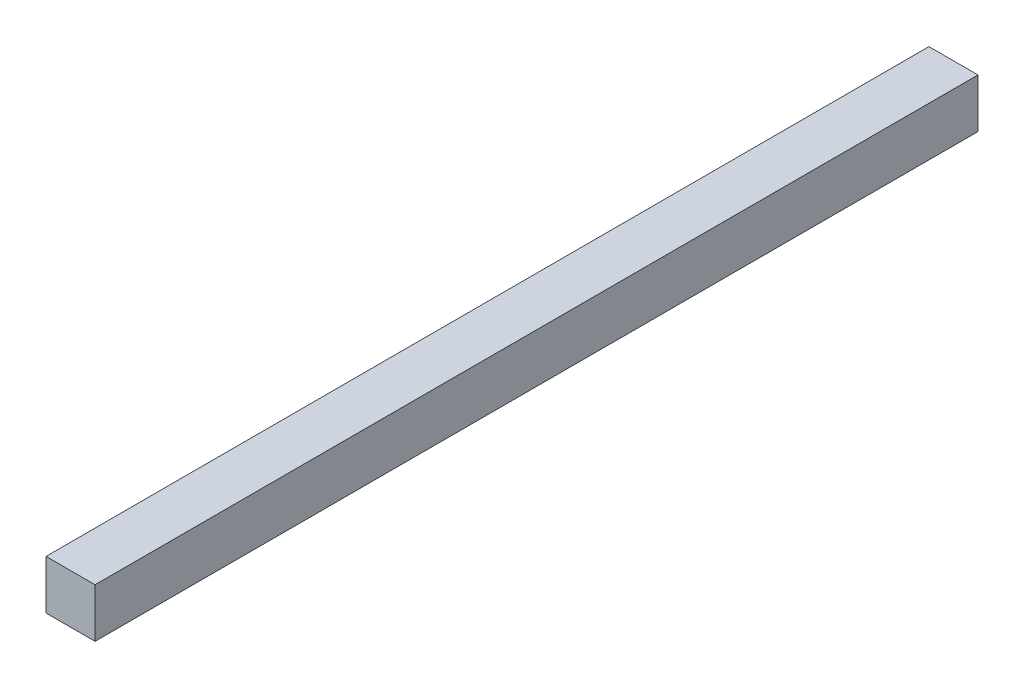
ISO-10303-21;
HEADER;
FILE_DESCRIPTION(('STEP AP214'),'2;1');
FILE_NAME('part.step','',(''),(''),'','','');
FILE_SCHEMA(('AUTOMOTIVE_DESIGN { 1 0 10303 214 1 1 1 1 }'));
ENDSEC;
DATA;
#1=APPLICATION_CONTEXT('core data for automotive mechanical design processes');
#2=APPLICATION_PROTOCOL_DEFINITION('international standard','automotive_design',2000,#1);
#3=PRODUCT_CONTEXT('',#1,'mechanical');
#4=PRODUCT('Part','Part','',(#3));
#5=PRODUCT_RELATED_PRODUCT_CATEGORY('part','',(#4));
#6=PRODUCT_DEFINITION_FORMATION('','',#4);
#7=PRODUCT_DEFINITION_CONTEXT('part definition',#1,'design');
#8=PRODUCT_DEFINITION('design','',#6,#7);
#9=PRODUCT_DEFINITION_SHAPE('','',#8);
#10=(LENGTH_UNIT() NAMED_UNIT(*) SI_UNIT(.MILLI.,.METRE.));
#11=(NAMED_UNIT(*) PLANE_ANGLE_UNIT() SI_UNIT($,.RADIAN.));
#12=(NAMED_UNIT(*) SI_UNIT($,.STERADIAN.) SOLID_ANGLE_UNIT());
#13=UNCERTAINTY_MEASURE_WITH_UNIT(LENGTH_MEASURE(1.E-05),#10,'distance_accuracy_value','');
#14=(GEOMETRIC_REPRESENTATION_CONTEXT(3) GLOBAL_UNCERTAINTY_ASSIGNED_CONTEXT((#13)) GLOBAL_UNIT_ASSIGNED_CONTEXT((#10,
#11,#12)) REPRESENTATION_CONTEXT('',''));
#15=CARTESIAN_POINT('',(0.,0.,0.));
#16=DIRECTION('',(0.,0.,1.));
#17=DIRECTION('',(1.,0.,0.));
#18=AXIS2_PLACEMENT_3D('',#15,#16,#17);
#19=CARTESIAN_POINT('',(10.,10.,360.));
#20=DIRECTION('',(-1.,0.,0.));
#21=DIRECTION('',(0.,0.,1.));
#22=AXIS2_PLACEMENT_3D('',#19,#20,#21);
#23=PLANE('',#22);
#24=DIRECTION('',(0.,1.,0.));
#25=VECTOR('',#24,1.);
#26=CARTESIAN_POINT('',(10.,10.,0.));
#27=LINE('',#26,#25);
#28=CARTESIAN_POINT('',(10.,-10.,0.));
#29=VERTEX_POINT('',#28);
#30=CARTESIAN_POINT('',(10.,10.,0.));
#31=VERTEX_POINT('',#30);
#32=EDGE_CURVE('E78',#29,#31,#27,.T.);
#33=ORIENTED_EDGE('',*,*,#32,.T.);
#34=DIRECTION('',(0.,0.,-1.));
#35=VECTOR('',#34,1.);
#36=CARTESIAN_POINT('',(10.,10.,360.));
#37=LINE('',#36,#35);
#38=CARTESIAN_POINT('',(10.,10.,360.));
#39=VERTEX_POINT('',#38);
#40=EDGE_CURVE('E11',#39,#31,#37,.T.);
#41=ORIENTED_EDGE('',*,*,#40,.F.);
#42=DIRECTION('',(0.,1.,0.));
#43=VECTOR('',#42,1.);
#44=CARTESIAN_POINT('',(10.,10.,360.));
#45=LINE('',#44,#43);
#46=CARTESIAN_POINT('',(10.,-10.,360.));
#47=VERTEX_POINT('',#46);
#48=EDGE_CURVE('E70',#47,#39,#45,.T.);
#49=ORIENTED_EDGE('',*,*,#48,.F.);
#50=DIRECTION('',(0.,0.,-1.));
#51=VECTOR('',#50,1.);
#52=CARTESIAN_POINT('',(10.,-10.,360.));
#53=LINE('',#52,#51);
#54=EDGE_CURVE('E74',#47,#29,#53,.T.);
#55=ORIENTED_EDGE('',*,*,#54,.T.);
#56=EDGE_LOOP('',(#33,#41,#49,#55));
#57=FACE_BOUND('',#56,.T.);
#58=ADVANCED_FACE('F16',(#57),#23,.F.);
#59=CARTESIAN_POINT('',(-10.,10.,360.));
#60=DIRECTION('',(0.,-1.,0.));
#61=DIRECTION('',(0.,0.,-1.));
#62=AXIS2_PLACEMENT_3D('',#59,#60,#61);
#63=PLANE('',#62);
#64=DIRECTION('',(-1.,0.,0.));
#65=VECTOR('',#64,1.);
#66=CARTESIAN_POINT('',(-10.,10.,0.));
#67=LINE('',#66,#65);
#68=CARTESIAN_POINT('',(-10.,10.,0.));
#69=VERTEX_POINT('',#68);
#70=EDGE_CURVE('E75',#31,#69,#67,.T.);
#71=ORIENTED_EDGE('',*,*,#70,.T.);
#72=DIRECTION('',(0.,0.,-1.));
#73=VECTOR('',#72,1.);
#74=CARTESIAN_POINT('',(-10.,10.,360.));
#75=LINE('',#74,#73);
#76=CARTESIAN_POINT('',(-10.,10.,360.));
#77=VERTEX_POINT('',#76);
#78=EDGE_CURVE('E24',#77,#69,#75,.T.);
#79=ORIENTED_EDGE('',*,*,#78,.F.);
#80=DIRECTION('',(-1.,0.,0.));
#81=VECTOR('',#80,1.);
#82=CARTESIAN_POINT('',(-10.,10.,360.));
#83=LINE('',#82,#81);
#84=EDGE_CURVE('E62',#39,#77,#83,.T.);
#85=ORIENTED_EDGE('',*,*,#84,.F.);
#86=ORIENTED_EDGE('',*,*,#40,.T.);
#87=EDGE_LOOP('',(#71,#79,#85,#86));
#88=FACE_BOUND('',#87,.T.);
#89=ADVANCED_FACE('F69',(#88),#63,.F.);
#90=CARTESIAN_POINT('',(-10.,10.,360.));
#91=DIRECTION('',(1.,0.,0.));
#92=DIRECTION('',(0.,1.,0.));
#93=AXIS2_PLACEMENT_3D('',#90,#91,#92);
#94=PLANE('',#93);
#95=DIRECTION('',(0.,-1.,0.));
#96=VECTOR('',#95,1.);
#97=CARTESIAN_POINT('',(-10.,10.,0.));
#98=LINE('',#97,#96);
#99=CARTESIAN_POINT('',(-10.,-10.,0.));
#100=VERTEX_POINT('',#99);
#101=EDGE_CURVE('E47',#69,#100,#98,.T.);
#102=ORIENTED_EDGE('',*,*,#101,.T.);
#103=DIRECTION('',(0.,0.,-1.));
#104=VECTOR('',#103,1.);
#105=CARTESIAN_POINT('',(-10.,-10.,360.));
#106=LINE('',#105,#104);
#107=CARTESIAN_POINT('',(-10.,-10.,360.));
#108=VERTEX_POINT('',#107);
#109=EDGE_CURVE('E71',#108,#100,#106,.T.);
#110=ORIENTED_EDGE('',*,*,#109,.F.);
#111=DIRECTION('',(0.,-1.,0.));
#112=VECTOR('',#111,1.);
#113=CARTESIAN_POINT('',(-10.,10.,360.));
#114=LINE('',#113,#112);
#115=EDGE_CURVE('E65',#77,#108,#114,.T.);
#116=ORIENTED_EDGE('',*,*,#115,.F.);
#117=ORIENTED_EDGE('',*,*,#78,.T.);
#118=EDGE_LOOP('',(#102,#110,#116,#117));
#119=FACE_BOUND('',#118,.T.);
#120=ADVANCED_FACE('F73',(#119),#94,.F.);
#121=CARTESIAN_POINT('',(-10.,-10.,360.));
#122=DIRECTION('',(0.,1.,0.));
#123=DIRECTION('',(0.,0.,1.));
#124=AXIS2_PLACEMENT_3D('',#121,#122,#123);
#125=PLANE('',#124);
#126=DIRECTION('',(1.,0.,0.));
#127=VECTOR('',#126,1.);
#128=CARTESIAN_POINT('',(-10.,-10.,0.));
#129=LINE('',#128,#127);
#130=EDGE_CURVE('E54',#100,#29,#129,.T.);
#131=ORIENTED_EDGE('',*,*,#130,.T.);
#132=ORIENTED_EDGE('',*,*,#54,.F.);
#133=DIRECTION('',(1.,0.,0.));
#134=VECTOR('',#133,1.);
#135=CARTESIAN_POINT('',(-10.,-10.,360.));
#136=LINE('',#135,#134);
#137=EDGE_CURVE('E32',#108,#47,#136,.T.);
#138=ORIENTED_EDGE('',*,*,#137,.F.);
#139=ORIENTED_EDGE('',*,*,#109,.T.);
#140=EDGE_LOOP('',(#131,#132,#138,#139));
#141=FACE_BOUND('',#140,.T.);
#142=ADVANCED_FACE('F88',(#141),#125,.F.);
#143=CARTESIAN_POINT('',(0.,0.,360.));
#144=DIRECTION('',(0.,0.,1.));
#145=DIRECTION('',(1.,0.,0.));
#146=AXIS2_PLACEMENT_3D('',#143,#144,#145);
#147=PLANE('',#146);
#148=ORIENTED_EDGE('',*,*,#48,.T.);
#149=ORIENTED_EDGE('',*,*,#84,.T.);
#150=ORIENTED_EDGE('',*,*,#115,.T.);
#151=ORIENTED_EDGE('',*,*,#137,.T.);
#152=EDGE_LOOP('',(#148,#149,#150,#151));
#153=FACE_BOUND('',#152,.T.);
#154=ADVANCED_FACE('F64',(#153),#147,.T.);
#155=CARTESIAN_POINT('',(0.,0.,0.));
#156=DIRECTION('',(0.,0.,1.));
#157=DIRECTION('',(1.,0.,0.));
#158=AXIS2_PLACEMENT_3D('',#155,#156,#157);
#159=PLANE('',#158);
#160=ORIENTED_EDGE('',*,*,#32,.F.);
#161=ORIENTED_EDGE('',*,*,#130,.F.);
#162=ORIENTED_EDGE('',*,*,#101,.F.);
#163=ORIENTED_EDGE('',*,*,#70,.F.);
#164=EDGE_LOOP('',(#160,#161,#162,#163));
#165=FACE_BOUND('',#164,.T.);
#166=ADVANCED_FACE('F90',(#165),#159,.F.);
#167=CLOSED_SHELL('',(#58,#89,#120,#142,#154,#166));
#168=MANIFOLD_SOLID_BREP('B1',#167);
#169=ADVANCED_BREP_SHAPE_REPRESENTATION('',(#18,#168),#14);
#170=SHAPE_DEFINITION_REPRESENTATION(#9,#169);
ENDSEC;
END-ISO-10303-21;
